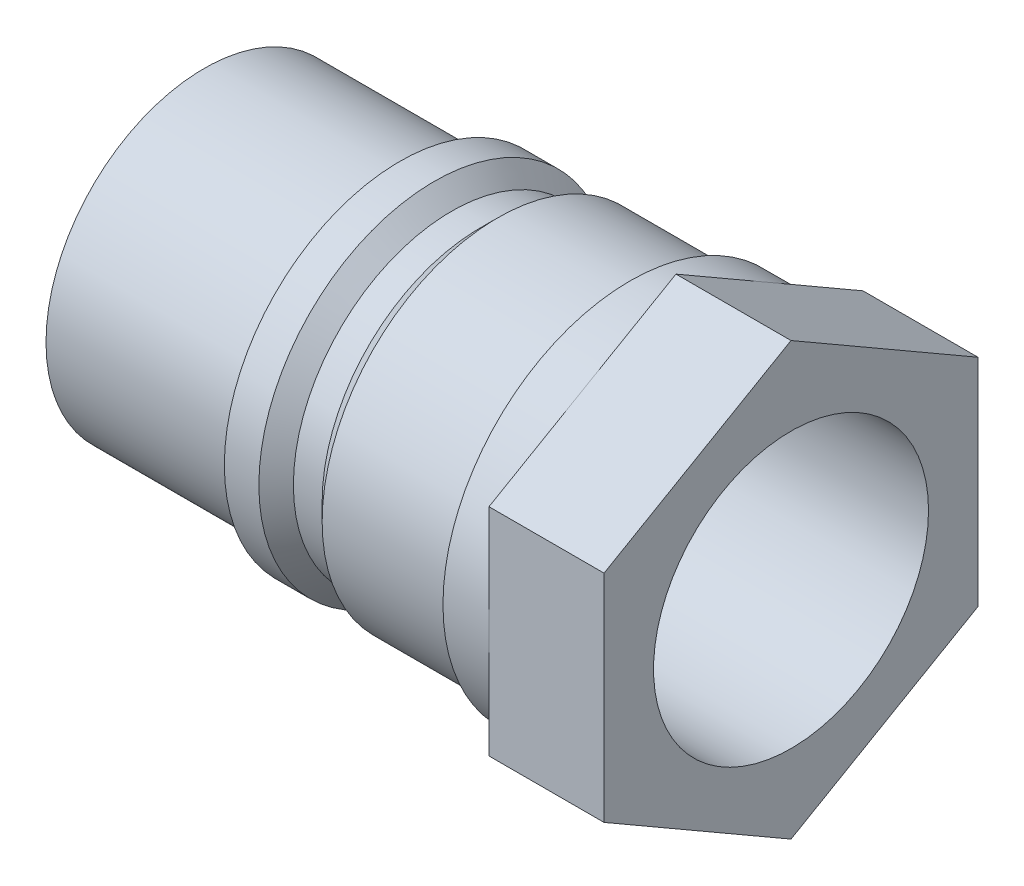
ISO-10303-21;
HEADER;
FILE_DESCRIPTION(('STEP AP214'),'2;1');
FILE_NAME('part.step','',(''),(''),'','','');
FILE_SCHEMA(('AUTOMOTIVE_DESIGN { 1 0 10303 214 1 1 1 1 }'));
ENDSEC;
DATA;
#1=APPLICATION_CONTEXT('core data for automotive mechanical design processes');
#2=APPLICATION_PROTOCOL_DEFINITION('international standard','automotive_design',2000,#1);
#3=PRODUCT_CONTEXT('',#1,'mechanical');
#4=PRODUCT('Part','Part','',(#3));
#5=PRODUCT_RELATED_PRODUCT_CATEGORY('part','',(#4));
#6=PRODUCT_DEFINITION_FORMATION('','',#4);
#7=PRODUCT_DEFINITION_CONTEXT('part definition',#1,'design');
#8=PRODUCT_DEFINITION('design','',#6,#7);
#9=PRODUCT_DEFINITION_SHAPE('','',#8);
#10=(LENGTH_UNIT() NAMED_UNIT(*) SI_UNIT(.MILLI.,.METRE.));
#11=(NAMED_UNIT(*) PLANE_ANGLE_UNIT() SI_UNIT($,.RADIAN.));
#12=(NAMED_UNIT(*) SI_UNIT($,.STERADIAN.) SOLID_ANGLE_UNIT());
#13=UNCERTAINTY_MEASURE_WITH_UNIT(LENGTH_MEASURE(1.E-05),#10,'distance_accuracy_value','');
#14=(GEOMETRIC_REPRESENTATION_CONTEXT(3) GLOBAL_UNCERTAINTY_ASSIGNED_CONTEXT((#13)) GLOBAL_UNIT_ASSIGNED_CONTEXT((#10,
#11,#12)) REPRESENTATION_CONTEXT('',''));
#15=CARTESIAN_POINT('',(0.,0.,0.));
#16=DIRECTION('',(0.,0.,1.));
#17=DIRECTION('',(1.,0.,0.));
#18=AXIS2_PLACEMENT_3D('',#15,#16,#17);
#19=CARTESIAN_POINT('',(0.,0.,0.));
#20=DIRECTION('',(1.,0.,0.));
#21=DIRECTION('',(0.,0.,-1.));
#22=AXIS2_PLACEMENT_3D('',#19,#20,#21);
#23=PLANE('',#22);
#24=CARTESIAN_POINT('',(0.,0.,0.));
#25=DIRECTION('',(1.,0.,0.));
#26=DIRECTION('',(0.,0.,-1.));
#27=AXIS2_PLACEMENT_3D('',#24,#25,#26);
#28=CIRCLE('',#27,23.9);
#29=CARTESIAN_POINT('',(0.,0.,-23.9));
#30=VERTEX_POINT('',#29);
#31=EDGE_CURVE('E272',#30,#30,#28,.T.);
#32=ORIENTED_EDGE('',*,*,#31,.T.);
#33=EDGE_LOOP('',(#32));
#34=FACE_BOUND('',#33,.T.);
#35=CARTESIAN_POINT('',(0.,0.,0.));
#36=DIRECTION('',(-1.,0.,0.));
#37=DIRECTION('',(0.,0.,1.));
#38=AXIS2_PLACEMENT_3D('',#35,#36,#37);
#39=CIRCLE('',#38,27.5);
#40=CARTESIAN_POINT('',(0.,0.,27.5));
#41=VERTEX_POINT('',#40);
#42=EDGE_CURVE('E11',#41,#41,#39,.T.);
#43=ORIENTED_EDGE('',*,*,#42,.T.);
#44=EDGE_LOOP('',(#43));
#45=FACE_BOUND('',#44,.T.);
#46=ADVANCED_FACE('F33',(#34,#45),#23,.F.);
#47=CARTESIAN_POINT('',(0.,0.,0.));
#48=DIRECTION('',(-1.,0.,0.));
#49=DIRECTION('',(0.,0.,1.));
#50=AXIS2_PLACEMENT_3D('',#47,#48,#49);
#51=CYLINDRICAL_SURFACE('',#50,27.5);
#52=ORIENTED_EDGE('',*,*,#42,.F.);
#53=EDGE_LOOP('',(#52));
#54=FACE_BOUND('',#53,.T.);
#55=CARTESIAN_POINT('',(34.,0.,0.));
#56=DIRECTION('',(-1.,0.,0.));
#57=DIRECTION('',(0.,0.,1.));
#58=AXIS2_PLACEMENT_3D('',#55,#56,#57);
#59=CIRCLE('',#58,27.5);
#60=CARTESIAN_POINT('',(34.,0.,27.5));
#61=VERTEX_POINT('',#60);
#62=EDGE_CURVE('E40',#61,#61,#59,.T.);
#63=ORIENTED_EDGE('',*,*,#62,.T.);
#64=EDGE_LOOP('',(#63));
#65=FACE_BOUND('',#64,.T.);
#66=ADVANCED_FACE('F164',(#54,#65),#51,.T.);
#67=CARTESIAN_POINT('',(34.,27.5,0.));
#68=DIRECTION('',(1.,0.,0.));
#69=DIRECTION('',(0.,0.,-1.));
#70=AXIS2_PLACEMENT_3D('',#67,#68,#69);
#71=PLANE('',#70);
#72=ORIENTED_EDGE('',*,*,#62,.F.);
#73=EDGE_LOOP('',(#72));
#74=FACE_BOUND('',#73,.T.);
#75=CARTESIAN_POINT('',(34.,0.,0.));
#76=DIRECTION('',(-1.,0.,0.));
#77=DIRECTION('',(0.,0.,1.));
#78=AXIS2_PLACEMENT_3D('',#75,#76,#77);
#79=CIRCLE('',#78,30.5);
#80=CARTESIAN_POINT('',(34.,0.,30.5));
#81=VERTEX_POINT('',#80);
#82=EDGE_CURVE('E159',#81,#81,#79,.T.);
#83=ORIENTED_EDGE('',*,*,#82,.T.);
#84=EDGE_LOOP('',(#83));
#85=FACE_BOUND('',#84,.T.);
#86=ADVANCED_FACE('F166',(#74,#85),#71,.F.);
#87=CARTESIAN_POINT('',(0.,0.,0.));
#88=DIRECTION('',(-1.,0.,0.));
#89=DIRECTION('',(0.,0.,1.));
#90=AXIS2_PLACEMENT_3D('',#87,#88,#89);
#91=CYLINDRICAL_SURFACE('',#90,30.5);
#92=ORIENTED_EDGE('',*,*,#82,.F.);
#93=EDGE_LOOP('',(#92));
#94=FACE_BOUND('',#93,.T.);
#95=CARTESIAN_POINT('',(40.,0.,0.));
#96=DIRECTION('',(-1.,0.,0.));
#97=DIRECTION('',(0.,0.,1.));
#98=AXIS2_PLACEMENT_3D('',#95,#96,#97);
#99=CIRCLE('',#98,30.5);
#100=CARTESIAN_POINT('',(40.,0.,30.5));
#101=VERTEX_POINT('',#100);
#102=EDGE_CURVE('E156',#101,#101,#99,.T.);
#103=ORIENTED_EDGE('',*,*,#102,.T.);
#104=EDGE_LOOP('',(#103));
#105=FACE_BOUND('',#104,.T.);
#106=ADVANCED_FACE('F169',(#94,#105),#91,.T.);
#107=CARTESIAN_POINT('',(43.,0.,0.));
#108=DIRECTION('',(-1.,0.,0.));
#109=DIRECTION('',(0.,0.,1.));
#110=AXIS2_PLACEMENT_3D('',#107,#108,#109);
#111=CONICAL_SURFACE('',#110,27.5,0.785398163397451);
#112=ORIENTED_EDGE('',*,*,#102,.F.);
#113=EDGE_LOOP('',(#112));
#114=FACE_BOUND('',#113,.T.);
#115=CARTESIAN_POINT('',(43.,0.,0.));
#116=DIRECTION('',(-1.,0.,0.));
#117=DIRECTION('',(0.,0.,1.));
#118=AXIS2_PLACEMENT_3D('',#115,#116,#117);
#119=CIRCLE('',#118,27.5);
#120=CARTESIAN_POINT('',(43.,0.,27.5));
#121=VERTEX_POINT('',#120);
#122=EDGE_CURVE('E153',#121,#121,#119,.T.);
#123=ORIENTED_EDGE('',*,*,#122,.T.);
#124=EDGE_LOOP('',(#123));
#125=FACE_BOUND('',#124,.T.);
#126=ADVANCED_FACE('F175',(#114,#125),#111,.T.);
#127=CARTESIAN_POINT('',(0.,0.,0.));
#128=DIRECTION('',(-1.,0.,0.));
#129=DIRECTION('',(0.,0.,1.));
#130=AXIS2_PLACEMENT_3D('',#127,#128,#129);
#131=CYLINDRICAL_SURFACE('',#130,27.5);
#132=ORIENTED_EDGE('',*,*,#122,.F.);
#133=EDGE_LOOP('',(#132));
#134=FACE_BOUND('',#133,.T.);
#135=CARTESIAN_POINT('',(48.,0.,0.));
#136=DIRECTION('',(-1.,0.,0.));
#137=DIRECTION('',(0.,0.,1.));
#138=AXIS2_PLACEMENT_3D('',#135,#136,#137);
#139=CIRCLE('',#138,27.5);
#140=CARTESIAN_POINT('',(48.,0.,27.5));
#141=VERTEX_POINT('',#140);
#142=EDGE_CURVE('E150',#141,#141,#139,.T.);
#143=ORIENTED_EDGE('',*,*,#142,.T.);
#144=EDGE_LOOP('',(#143));
#145=FACE_BOUND('',#144,.T.);
#146=ADVANCED_FACE('F181',(#134,#145),#131,.T.);
#147=CARTESIAN_POINT('',(51.,0.,0.));
#148=DIRECTION('',(1.,0.,0.));
#149=DIRECTION('',(0.,0.,-1.));
#150=AXIS2_PLACEMENT_3D('',#147,#148,#149);
#151=CONICAL_SURFACE('',#150,30.5,0.785398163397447);
#152=ORIENTED_EDGE('',*,*,#142,.F.);
#153=EDGE_LOOP('',(#152));
#154=FACE_BOUND('',#153,.T.);
#155=CARTESIAN_POINT('',(51.,0.,0.));
#156=DIRECTION('',(-1.,0.,0.));
#157=DIRECTION('',(0.,0.,1.));
#158=AXIS2_PLACEMENT_3D('',#155,#156,#157);
#159=CIRCLE('',#158,30.5);
#160=CARTESIAN_POINT('',(51.,0.,30.5));
#161=VERTEX_POINT('',#160);
#162=EDGE_CURVE('E147',#161,#161,#159,.T.);
#163=ORIENTED_EDGE('',*,*,#162,.T.);
#164=EDGE_LOOP('',(#163));
#165=FACE_BOUND('',#164,.T.);
#166=ADVANCED_FACE('F187',(#154,#165),#151,.T.);
#167=CARTESIAN_POINT('',(0.,0.,0.));
#168=DIRECTION('',(-1.,0.,0.));
#169=DIRECTION('',(0.,0.,1.));
#170=AXIS2_PLACEMENT_3D('',#167,#168,#169);
#171=CYLINDRICAL_SURFACE('',#170,30.5);
#172=ORIENTED_EDGE('',*,*,#162,.F.);
#173=EDGE_LOOP('',(#172));
#174=FACE_BOUND('',#173,.T.);
#175=CARTESIAN_POINT('',(74.,0.,0.));
#176=DIRECTION('',(-1.,0.,0.));
#177=DIRECTION('',(0.,0.,1.));
#178=AXIS2_PLACEMENT_3D('',#175,#176,#177);
#179=CIRCLE('',#178,30.5);
#180=CARTESIAN_POINT('',(74.,0.,30.5));
#181=VERTEX_POINT('',#180);
#182=EDGE_CURVE('E144',#181,#181,#179,.T.);
#183=ORIENTED_EDGE('',*,*,#182,.T.);
#184=EDGE_LOOP('',(#183));
#185=FACE_BOUND('',#184,.T.);
#186=ADVANCED_FACE('F193',(#174,#185),#171,.T.);
#187=CARTESIAN_POINT('',(74.,30.5,0.));
#188=DIRECTION('',(1.,0.,0.));
#189=DIRECTION('',(0.,0.,-1.));
#190=AXIS2_PLACEMENT_3D('',#187,#188,#189);
#191=PLANE('',#190);
#192=ORIENTED_EDGE('',*,*,#182,.F.);
#193=EDGE_LOOP('',(#192));
#194=FACE_BOUND('',#193,.T.);
#195=CARTESIAN_POINT('',(74.,0.,0.));
#196=DIRECTION('',(-1.,0.,0.));
#197=DIRECTION('',(0.,0.,1.));
#198=AXIS2_PLACEMENT_3D('',#195,#196,#197);
#199=CIRCLE('',#198,32.5);
#200=CARTESIAN_POINT('',(74.,0.,32.5));
#201=VERTEX_POINT('',#200);
#202=EDGE_CURVE('E141',#201,#201,#199,.T.);
#203=ORIENTED_EDGE('',*,*,#202,.T.);
#204=EDGE_LOOP('',(#203));
#205=FACE_BOUND('',#204,.T.);
#206=ADVANCED_FACE('F199',(#194,#205),#191,.F.);
#207=CARTESIAN_POINT('',(0.,0.,0.));
#208=DIRECTION('',(-1.,0.,0.));
#209=DIRECTION('',(0.,0.,1.));
#210=AXIS2_PLACEMENT_3D('',#207,#208,#209);
#211=CYLINDRICAL_SURFACE('',#210,32.5);
#212=ORIENTED_EDGE('',*,*,#202,.F.);
#213=EDGE_LOOP('',(#212));
#214=FACE_BOUND('',#213,.T.);
#215=CARTESIAN_POINT('',(82.,0.,0.));
#216=DIRECTION('',(-1.,0.,0.));
#217=DIRECTION('',(0.,0.,1.));
#218=AXIS2_PLACEMENT_3D('',#215,#216,#217);
#219=CIRCLE('',#218,32.5);
#220=CARTESIAN_POINT('',(82.,0.,32.5));
#221=VERTEX_POINT('',#220);
#222=CARTESIAN_POINT('',(82.,28.1458256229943,16.25));
#223=VERTEX_POINT('',#222);
#224=EDGE_CURVE('E135',#221,#223,#219,.T.);
#225=ORIENTED_EDGE('',*,*,#224,.T.);
#226=CARTESIAN_POINT('',(82.,28.1458256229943,-16.25));
#227=VERTEX_POINT('',#226);
#228=EDGE_CURVE('E55',#223,#227,#219,.T.);
#229=ORIENTED_EDGE('',*,*,#228,.T.);
#230=CARTESIAN_POINT('',(82.,0.,-32.5));
#231=VERTEX_POINT('',#230);
#232=EDGE_CURVE('E280',#227,#231,#219,.T.);
#233=ORIENTED_EDGE('',*,*,#232,.T.);
#234=CARTESIAN_POINT('',(82.,-28.1458256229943,-16.25));
#235=VERTEX_POINT('',#234);
#236=EDGE_CURVE('E281',#231,#235,#219,.T.);
#237=ORIENTED_EDGE('',*,*,#236,.T.);
#238=CARTESIAN_POINT('',(82.,-28.1458256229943,16.25));
#239=VERTEX_POINT('',#238);
#240=EDGE_CURVE('E133',#235,#239,#219,.T.);
#241=ORIENTED_EDGE('',*,*,#240,.T.);
#242=EDGE_CURVE('E130',#239,#221,#219,.T.);
#243=ORIENTED_EDGE('',*,*,#242,.T.);
#244=EDGE_LOOP('',(#225,#229,#233,#237,#241,#243));
#245=FACE_BOUND('',#244,.T.);
#246=ADVANCED_FACE('F205',(#214,#245),#211,.T.);
#247=CARTESIAN_POINT('',(82.,0.,0.));
#248=DIRECTION('',(1.,0.,0.));
#249=DIRECTION('',(0.,0.,-1.));
#250=AXIS2_PLACEMENT_3D('',#247,#248,#249);
#251=PLANE('',#250);
#252=ORIENTED_EDGE('',*,*,#224,.F.);
#253=DIRECTION('',(0.,-1.,0.));
#254=VECTOR('',#253,1.);
#255=CARTESIAN_POINT('',(82.,18.7638837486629,32.5));
#256=LINE('',#255,#254);
#257=CARTESIAN_POINT('',(82.,18.7638837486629,32.5));
#258=VERTEX_POINT('',#257);
#259=EDGE_CURVE('E47',#258,#221,#256,.T.);
#260=ORIENTED_EDGE('',*,*,#259,.F.);
#261=DIRECTION('',(0.,-0.5,0.866025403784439));
#262=VECTOR('',#261,1.);
#263=CARTESIAN_POINT('',(82.,37.5277674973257,0.));
#264=LINE('',#263,#262);
#265=EDGE_CURVE('E217',#223,#258,#264,.T.);
#266=ORIENTED_EDGE('',*,*,#265,.F.);
#267=EDGE_LOOP('',(#252,#260,#266));
#268=FACE_BOUND('',#267,.T.);
#269=ADVANCED_FACE('F211',(#268),#251,.F.);
#270=ORIENTED_EDGE('',*,*,#228,.F.);
#271=CARTESIAN_POINT('',(82.,37.5277674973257,0.));
#272=VERTEX_POINT('',#271);
#273=EDGE_CURVE('E218',#272,#223,#264,.T.);
#274=ORIENTED_EDGE('',*,*,#273,.F.);
#275=DIRECTION('',(0.,0.5,0.866025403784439));
#276=VECTOR('',#275,1.);
#277=CARTESIAN_POINT('',(82.,18.7638837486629,-32.5));
#278=LINE('',#277,#276);
#279=EDGE_CURVE('E129',#227,#272,#278,.T.);
#280=ORIENTED_EDGE('',*,*,#279,.F.);
#281=EDGE_LOOP('',(#270,#274,#280));
#282=FACE_BOUND('',#281,.T.);
#283=ADVANCED_FACE('F282',(#282),#251,.F.);
#284=ORIENTED_EDGE('',*,*,#232,.F.);
#285=CARTESIAN_POINT('',(82.,18.7638837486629,-32.5));
#286=VERTEX_POINT('',#285);
#287=EDGE_CURVE('E219',#286,#227,#278,.T.);
#288=ORIENTED_EDGE('',*,*,#287,.F.);
#289=DIRECTION('',(0.,1.,0.));
#290=VECTOR('',#289,1.);
#291=CARTESIAN_POINT('',(82.,-18.7638837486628,-32.5));
#292=LINE('',#291,#290);
#293=EDGE_CURVE('E234',#231,#286,#292,.T.);
#294=ORIENTED_EDGE('',*,*,#293,.F.);
#295=EDGE_LOOP('',(#284,#288,#294));
#296=FACE_BOUND('',#295,.T.);
#297=ADVANCED_FACE('F279',(#296),#251,.F.);
#298=ORIENTED_EDGE('',*,*,#236,.F.);
#299=CARTESIAN_POINT('',(82.,-18.7638837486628,-32.5));
#300=VERTEX_POINT('',#299);
#301=EDGE_CURVE('E125',#300,#231,#292,.T.);
#302=ORIENTED_EDGE('',*,*,#301,.F.);
#303=DIRECTION('',(0.,0.5,-0.866025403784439));
#304=VECTOR('',#303,1.);
#305=CARTESIAN_POINT('',(82.,-37.5277674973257,0.));
#306=LINE('',#305,#304);
#307=EDGE_CURVE('E230',#235,#300,#306,.T.);
#308=ORIENTED_EDGE('',*,*,#307,.F.);
#309=EDGE_LOOP('',(#298,#302,#308));
#310=FACE_BOUND('',#309,.T.);
#311=ADVANCED_FACE('F289',(#310),#251,.F.);
#312=ORIENTED_EDGE('',*,*,#240,.F.);
#313=CARTESIAN_POINT('',(82.,-37.5277674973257,0.));
#314=VERTEX_POINT('',#313);
#315=EDGE_CURVE('E231',#314,#235,#306,.T.);
#316=ORIENTED_EDGE('',*,*,#315,.F.);
#317=DIRECTION('',(0.,-0.5,-0.866025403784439));
#318=VECTOR('',#317,1.);
#319=CARTESIAN_POINT('',(82.,-18.7638837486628,32.5));
#320=LINE('',#319,#318);
#321=EDGE_CURVE('E226',#239,#314,#320,.T.);
#322=ORIENTED_EDGE('',*,*,#321,.F.);
#323=EDGE_LOOP('',(#312,#316,#322));
#324=FACE_BOUND('',#323,.T.);
#325=ADVANCED_FACE('F257',(#324),#251,.F.);
#326=CARTESIAN_POINT('',(102.,18.7638837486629,-32.5));
#327=DIRECTION('',(0.,-0.866025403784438,0.5));
#328=DIRECTION('',(0.,-0.5,-0.866025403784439));
#329=AXIS2_PLACEMENT_3D('',#326,#327,#328);
#330=PLANE('',#329);
#331=ORIENTED_EDGE('',*,*,#287,.T.);
#332=ORIENTED_EDGE('',*,*,#279,.T.);
#333=DIRECTION('',(-1.,0.,0.));
#334=VECTOR('',#333,1.);
#335=CARTESIAN_POINT('',(102.,37.5277674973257,0.));
#336=LINE('',#335,#334);
#337=CARTESIAN_POINT('',(102.,37.5277674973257,0.));
#338=VERTEX_POINT('',#337);
#339=EDGE_CURVE('E111',#338,#272,#336,.T.);
#340=ORIENTED_EDGE('',*,*,#339,.F.);
#341=DIRECTION('',(0.,0.5,0.866025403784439));
#342=VECTOR('',#341,1.);
#343=CARTESIAN_POINT('',(102.,18.7638837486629,-32.5));
#344=LINE('',#343,#342);
#345=CARTESIAN_POINT('',(102.,18.7638837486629,-32.5));
#346=VERTEX_POINT('',#345);
#347=EDGE_CURVE('E116',#346,#338,#344,.T.);
#348=ORIENTED_EDGE('',*,*,#347,.F.);
#349=DIRECTION('',(-1.,0.,0.));
#350=VECTOR('',#349,1.);
#351=CARTESIAN_POINT('',(102.,18.7638837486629,-32.5));
#352=LINE('',#351,#350);
#353=EDGE_CURVE('E237',#346,#286,#352,.T.);
#354=ORIENTED_EDGE('',*,*,#353,.T.);
#355=EDGE_LOOP('',(#331,#332,#340,#348,#354));
#356=FACE_BOUND('',#355,.T.);
#357=ADVANCED_FACE('F128',(#356),#330,.F.);
#358=CARTESIAN_POINT('',(102.,37.5277674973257,0.));
#359=DIRECTION('',(0.,-0.866025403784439,-0.5));
#360=DIRECTION('',(0.,0.5,-0.866025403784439));
#361=AXIS2_PLACEMENT_3D('',#358,#359,#360);
#362=PLANE('',#361);
#363=ORIENTED_EDGE('',*,*,#273,.T.);
#364=ORIENTED_EDGE('',*,*,#265,.T.);
#365=DIRECTION('',(-1.,0.,0.));
#366=VECTOR('',#365,1.);
#367=CARTESIAN_POINT('',(102.,18.7638837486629,32.5));
#368=LINE('',#367,#366);
#369=CARTESIAN_POINT('',(102.,18.7638837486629,32.5));
#370=VERTEX_POINT('',#369);
#371=EDGE_CURVE('E112',#370,#258,#368,.T.);
#372=ORIENTED_EDGE('',*,*,#371,.F.);
#373=DIRECTION('',(0.,-0.5,0.866025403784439));
#374=VECTOR('',#373,1.);
#375=CARTESIAN_POINT('',(102.,37.5277674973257,0.));
#376=LINE('',#375,#374);
#377=EDGE_CURVE('E106',#338,#370,#376,.T.);
#378=ORIENTED_EDGE('',*,*,#377,.F.);
#379=ORIENTED_EDGE('',*,*,#339,.T.);
#380=EDGE_LOOP('',(#363,#364,#372,#378,#379));
#381=FACE_BOUND('',#380,.T.);
#382=ADVANCED_FACE('F109',(#381),#362,.F.);
#383=CARTESIAN_POINT('',(102.,18.7638837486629,32.5));
#384=DIRECTION('',(0.,0.,-1.));
#385=DIRECTION('',(-1.,0.,0.));
#386=AXIS2_PLACEMENT_3D('',#383,#384,#385);
#387=PLANE('',#386);
#388=ORIENTED_EDGE('',*,*,#259,.T.);
#389=CARTESIAN_POINT('',(82.,-18.7638837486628,32.5));
#390=VERTEX_POINT('',#389);
#391=EDGE_CURVE('E221',#221,#390,#256,.T.);
#392=ORIENTED_EDGE('',*,*,#391,.T.);
#393=DIRECTION('',(-1.,0.,0.));
#394=VECTOR('',#393,1.);
#395=CARTESIAN_POINT('',(102.,-18.7638837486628,32.5));
#396=LINE('',#395,#394);
#397=CARTESIAN_POINT('',(102.,-18.7638837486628,32.5));
#398=VERTEX_POINT('',#397);
#399=EDGE_CURVE('E136',#398,#390,#396,.T.);
#400=ORIENTED_EDGE('',*,*,#399,.F.);
#401=DIRECTION('',(0.,-1.,0.));
#402=VECTOR('',#401,1.);
#403=CARTESIAN_POINT('',(102.,18.7638837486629,32.5));
#404=LINE('',#403,#402);
#405=EDGE_CURVE('E115',#370,#398,#404,.T.);
#406=ORIENTED_EDGE('',*,*,#405,.F.);
#407=ORIENTED_EDGE('',*,*,#371,.T.);
#408=EDGE_LOOP('',(#388,#392,#400,#406,#407));
#409=FACE_BOUND('',#408,.T.);
#410=ADVANCED_FACE('F306',(#409),#387,.F.);
#411=CARTESIAN_POINT('',(102.,-18.7638837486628,32.5));
#412=DIRECTION('',(0.,0.866025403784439,-0.5));
#413=DIRECTION('',(0.,0.5,0.866025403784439));
#414=AXIS2_PLACEMENT_3D('',#411,#412,#413);
#415=PLANE('',#414);
#416=EDGE_CURVE('E227',#390,#239,#320,.T.);
#417=ORIENTED_EDGE('',*,*,#416,.T.);
#418=ORIENTED_EDGE('',*,*,#321,.T.);
#419=DIRECTION('',(-1.,0.,0.));
#420=VECTOR('',#419,1.);
#421=CARTESIAN_POINT('',(102.,-37.5277674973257,0.));
#422=LINE('',#421,#420);
#423=CARTESIAN_POINT('',(102.,-37.5277674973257,0.));
#424=VERTEX_POINT('',#423);
#425=EDGE_CURVE('E242',#424,#314,#422,.T.);
#426=ORIENTED_EDGE('',*,*,#425,.F.);
#427=DIRECTION('',(0.,-0.5,-0.866025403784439));
#428=VECTOR('',#427,1.);
#429=CARTESIAN_POINT('',(102.,-18.7638837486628,32.5));
#430=LINE('',#429,#428);
#431=EDGE_CURVE('E251',#398,#424,#430,.T.);
#432=ORIENTED_EDGE('',*,*,#431,.F.);
#433=ORIENTED_EDGE('',*,*,#399,.T.);
#434=EDGE_LOOP('',(#417,#418,#426,#432,#433));
#435=FACE_BOUND('',#434,.T.);
#436=ADVANCED_FACE('F249',(#435),#415,.F.);
#437=CARTESIAN_POINT('',(102.,-37.5277674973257,0.));
#438=DIRECTION('',(0.,0.866025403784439,0.5));
#439=DIRECTION('',(0.,-0.5,0.866025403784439));
#440=AXIS2_PLACEMENT_3D('',#437,#438,#439);
#441=PLANE('',#440);
#442=ORIENTED_EDGE('',*,*,#315,.T.);
#443=ORIENTED_EDGE('',*,*,#307,.T.);
#444=DIRECTION('',(-1.,0.,0.));
#445=VECTOR('',#444,1.);
#446=CARTESIAN_POINT('',(102.,-18.7638837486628,-32.5));
#447=LINE('',#446,#445);
#448=CARTESIAN_POINT('',(102.,-18.7638837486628,-32.5));
#449=VERTEX_POINT('',#448);
#450=EDGE_CURVE('E239',#449,#300,#447,.T.);
#451=ORIENTED_EDGE('',*,*,#450,.F.);
#452=DIRECTION('',(0.,0.5,-0.866025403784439));
#453=VECTOR('',#452,1.);
#454=CARTESIAN_POINT('',(102.,-37.5277674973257,0.));
#455=LINE('',#454,#453);
#456=EDGE_CURVE('E264',#424,#449,#455,.T.);
#457=ORIENTED_EDGE('',*,*,#456,.F.);
#458=ORIENTED_EDGE('',*,*,#425,.T.);
#459=EDGE_LOOP('',(#442,#443,#451,#457,#458));
#460=FACE_BOUND('',#459,.T.);
#461=ADVANCED_FACE('F261',(#460),#441,.F.);
#462=CARTESIAN_POINT('',(102.,-18.7638837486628,-32.5));
#463=DIRECTION('',(0.,0.,1.));
#464=DIRECTION('',(1.,0.,0.));
#465=AXIS2_PLACEMENT_3D('',#462,#463,#464);
#466=PLANE('',#465);
#467=ORIENTED_EDGE('',*,*,#301,.T.);
#468=ORIENTED_EDGE('',*,*,#293,.T.);
#469=ORIENTED_EDGE('',*,*,#353,.F.);
#470=DIRECTION('',(0.,1.,0.));
#471=VECTOR('',#470,1.);
#472=CARTESIAN_POINT('',(102.,-18.7638837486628,-32.5));
#473=LINE('',#472,#471);
#474=EDGE_CURVE('E121',#449,#346,#473,.T.);
#475=ORIENTED_EDGE('',*,*,#474,.F.);
#476=ORIENTED_EDGE('',*,*,#450,.T.);
#477=EDGE_LOOP('',(#467,#468,#469,#475,#476));
#478=FACE_BOUND('',#477,.T.);
#479=ADVANCED_FACE('F312',(#478),#466,.F.);
#480=CARTESIAN_POINT('',(102.,0.,0.));
#481=DIRECTION('',(1.,0.,0.));
#482=DIRECTION('',(0.,0.,-1.));
#483=AXIS2_PLACEMENT_3D('',#480,#481,#482);
#484=PLANE('',#483);
#485=CARTESIAN_POINT('',(102.,0.,0.));
#486=DIRECTION('',(1.,0.,0.));
#487=DIRECTION('',(0.,0.,-1.));
#488=AXIS2_PLACEMENT_3D('',#485,#486,#487);
#489=CIRCLE('',#488,23.9);
#490=CARTESIAN_POINT('',(102.,0.,-23.9));
#491=VERTEX_POINT('',#490);
#492=EDGE_CURVE('E269',#491,#491,#489,.T.);
#493=ORIENTED_EDGE('',*,*,#492,.F.);
#494=EDGE_LOOP('',(#493));
#495=FACE_BOUND('',#494,.T.);
#496=ORIENTED_EDGE('',*,*,#347,.T.);
#497=ORIENTED_EDGE('',*,*,#377,.T.);
#498=ORIENTED_EDGE('',*,*,#405,.T.);
#499=ORIENTED_EDGE('',*,*,#431,.T.);
#500=ORIENTED_EDGE('',*,*,#456,.T.);
#501=ORIENTED_EDGE('',*,*,#474,.T.);
#502=EDGE_LOOP('',(#496,#497,#498,#499,#500,#501));
#503=FACE_BOUND('',#502,.T.);
#504=ADVANCED_FACE('F119',(#495,#503),#484,.T.);
#505=ORIENTED_EDGE('',*,*,#242,.F.);
#506=ORIENTED_EDGE('',*,*,#416,.F.);
#507=ORIENTED_EDGE('',*,*,#391,.F.);
#508=EDGE_LOOP('',(#505,#506,#507));
#509=FACE_BOUND('',#508,.T.);
#510=ADVANCED_FACE('F253',(#509),#251,.F.);
#511=CARTESIAN_POINT('',(0.,0.,0.));
#512=DIRECTION('',(1.,0.,0.));
#513=DIRECTION('',(0.,0.,-1.));
#514=AXIS2_PLACEMENT_3D('',#511,#512,#513);
#515=CYLINDRICAL_SURFACE('',#514,23.9);
#516=ORIENTED_EDGE('',*,*,#31,.F.);
#517=EDGE_LOOP('',(#516));
#518=FACE_BOUND('',#517,.T.);
#519=ORIENTED_EDGE('',*,*,#492,.T.);
#520=EDGE_LOOP('',(#519));
#521=FACE_BOUND('',#520,.T.);
#522=ADVANCED_FACE('F328',(#518,#521),#515,.F.);
#523=CLOSED_SHELL('',(#46,#66,#86,#106,#126,#146,#166,#186,#206,#246,#269,#283,#297,#311,#325,
#357,#382,#410,#436,#461,#479,#504,#510,#522));
#524=MANIFOLD_SOLID_BREP('B2',#523);
#525=ADVANCED_BREP_SHAPE_REPRESENTATION('',(#18,#524),#14);
#526=SHAPE_DEFINITION_REPRESENTATION(#9,#525);
ENDSEC;
END-ISO-10303-21;
